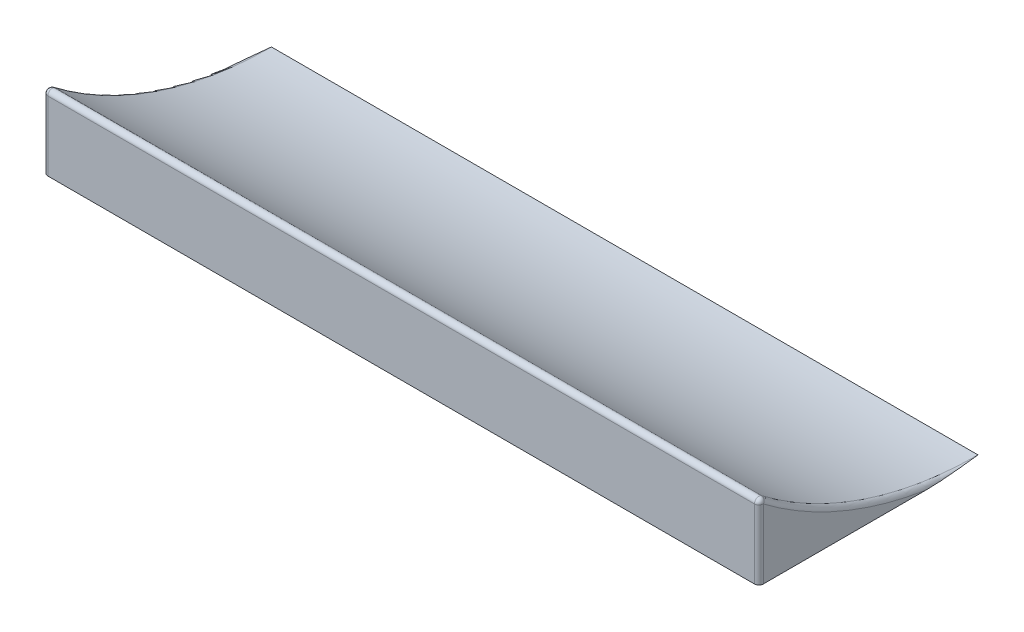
from build123d import *

# Parameters (mm, degrees)
BOSS_EXTRU_1_DEPTH      = 800
ESQUISSE2_R             = 5
ENL_V_MAT_EXTRU_1_DEPTH = 10
CONG_1_R                = 10


with BuildPart() as part:
    # Esquisse1 → Boss.-Extru.1 (new, symmetric)
    with BuildSketch(Plane(origin=(0, 0, 0), x_dir=(0, 0, -1), z_dir=(1, 0, 0))):
        with BuildLine():
            Line((0, 0), (500, 0))
            ThreePointArc((500, 0), (235.047022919, 45.149074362), (0, 175.50020016))
            Line((0, 175.50020016), (0, 0))
        make_face()
    extrude(amount=BOSS_EXTRU_1_DEPTH, both=True)

    # Esquisse2 → Enl_v. mat.-Extru.1 (cut)
    with BuildSketch(Plane.XZ):
        with Locations(Location((-250, -250, 0), (0, 0, 270))):
            Circle(ESQUISSE2_R)
        with Locations(Location((250, -250, 0), (0, 0, 90))):
            Circle(ESQUISSE2_R)
    extrude(amount=-ENL_V_MAT_EXTRU_1_DEPTH, mode=Mode.SUBTRACT)

    # Cong_1
    cong_1_edges = [part.edges().sort_by_distance(p)[0] for p in [
        (800, 45.149074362, -235.047022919),
        (-800, 45.149074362, -235.047022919),
        (800, 87.75010008, 0),
        (-800, 87.75010008, 0),
        (0, 175.50020016, 0),
    ]]
    fillet(cong_1_edges, radius=CONG_1_R)


solid = part.part
